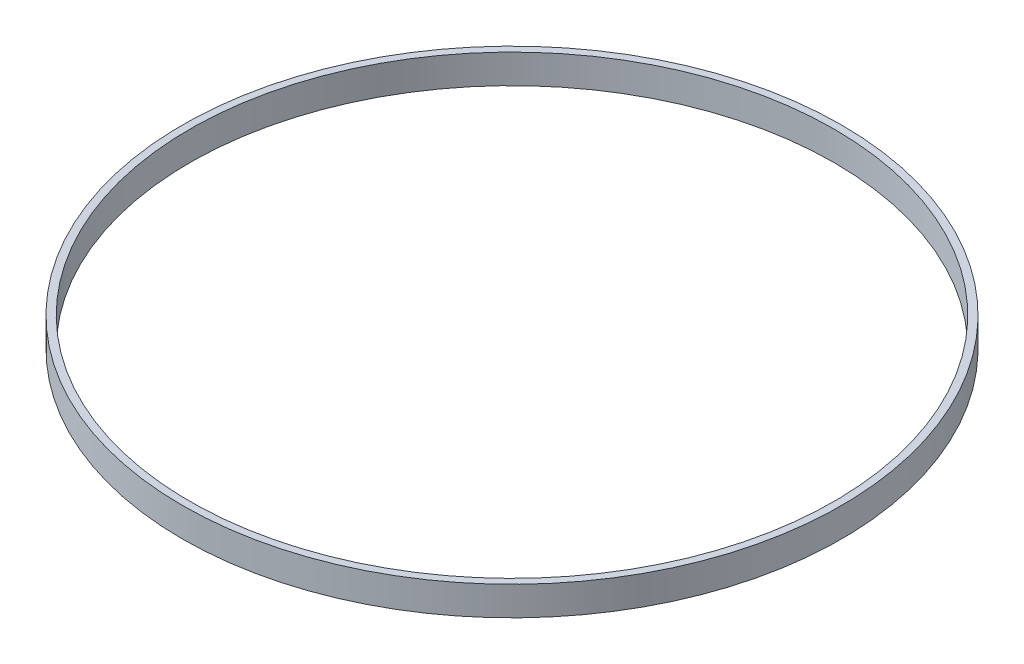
from build123d import *

# Parameters (mm, degrees)
SKETCH1_W = 4.7625
SKETCH1_H = 19.05


with BuildPart() as part:
    # Sketch1 → Revolve1 (revolve)
    with BuildSketch(Plane.XY, mode=Mode.PRIVATE) as revolve1_sk:
        with Locations((-213.51875, 9.525)):
            Rectangle(SKETCH1_W, SKETCH1_H)
    revolve(revolve1_sk.sketch.rotate(Axis((0, 0, 0), (0, 1, 0)), 270), axis=Axis((0, 0, 0), (0, 1, 0)))


solid = part.part
